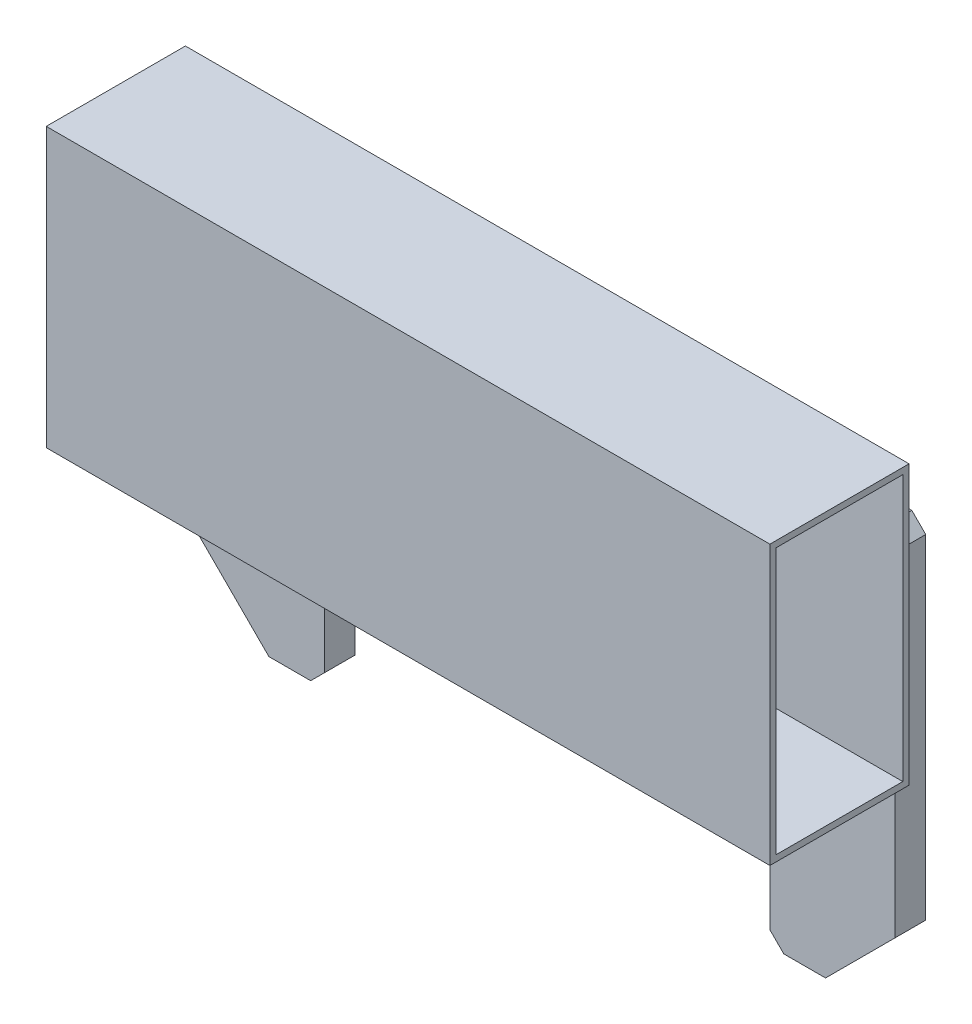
ISO-10303-21;
HEADER;
FILE_DESCRIPTION(('STEP AP214'),'2;1');
FILE_NAME('part.step','',(''),(''),'','','');
FILE_SCHEMA(('AUTOMOTIVE_DESIGN { 1 0 10303 214 1 1 1 1 }'));
ENDSEC;
DATA;
#1=APPLICATION_CONTEXT('core data for automotive mechanical design processes');
#2=APPLICATION_PROTOCOL_DEFINITION('international standard','automotive_design',2000,#1);
#3=PRODUCT_CONTEXT('',#1,'mechanical');
#4=PRODUCT('Part','Part','',(#3));
#5=PRODUCT_RELATED_PRODUCT_CATEGORY('part','',(#4));
#6=PRODUCT_DEFINITION_FORMATION('','',#4);
#7=PRODUCT_DEFINITION_CONTEXT('part definition',#1,'design');
#8=PRODUCT_DEFINITION('design','',#6,#7);
#9=PRODUCT_DEFINITION_SHAPE('','',#8);
#10=(LENGTH_UNIT() NAMED_UNIT(*) SI_UNIT(.MILLI.,.METRE.));
#11=(NAMED_UNIT(*) PLANE_ANGLE_UNIT() SI_UNIT($,.RADIAN.));
#12=(NAMED_UNIT(*) SI_UNIT($,.STERADIAN.) SOLID_ANGLE_UNIT());
#13=UNCERTAINTY_MEASURE_WITH_UNIT(LENGTH_MEASURE(1.E-05),#10,'distance_accuracy_value','');
#14=(GEOMETRIC_REPRESENTATION_CONTEXT(3) GLOBAL_UNCERTAINTY_ASSIGNED_CONTEXT((#13)) GLOBAL_UNIT_ASSIGNED_CONTEXT((#10,
#11,#12)) REPRESENTATION_CONTEXT('',''));
#15=CARTESIAN_POINT('',(0.,0.,0.));
#16=DIRECTION('',(0.,0.,1.));
#17=DIRECTION('',(1.,0.,0.));
#18=AXIS2_PLACEMENT_3D('',#15,#16,#17);
#19=CARTESIAN_POINT('',(-520.,378.,0.));
#20=DIRECTION('',(0.,0.,-1.));
#21=DIRECTION('',(0.,1.,0.));
#22=AXIS2_PLACEMENT_3D('',#19,#20,#21);
#23=PLANE('',#22);
#24=DIRECTION('',(0.,1.,0.));
#25=VECTOR('',#24,1.);
#26=CARTESIAN_POINT('',(-420.,528.,0.));
#27=LINE('',#26,#25);
#28=CARTESIAN_POINT('',(-420.,378.,0.));
#29=VERTEX_POINT('',#28);
#30=CARTESIAN_POINT('',(-420.,518.,0.));
#31=VERTEX_POINT('',#30);
#32=EDGE_CURVE('E334',#29,#31,#27,.T.);
#33=ORIENTED_EDGE('',*,*,#32,.T.);
#34=DIRECTION('',(0.707106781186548,-0.707106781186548,0.));
#35=VECTOR('',#34,1.);
#36=CARTESIAN_POINT('',(-420.,518.,0.));
#37=LINE('',#36,#35);
#38=CARTESIAN_POINT('',(-430.,528.,0.));
#39=VERTEX_POINT('',#38);
#40=EDGE_CURVE('E341',#31,#39,#37,.F.);
#41=ORIENTED_EDGE('',*,*,#40,.T.);
#42=DIRECTION('',(-1.,0.,0.));
#43=VECTOR('',#42,1.);
#44=CARTESIAN_POINT('',(-420.,528.,0.));
#45=LINE('',#44,#43);
#46=CARTESIAN_POINT('',(-500.,528.,0.));
#47=VERTEX_POINT('',#46);
#48=EDGE_CURVE('E218',#39,#47,#45,.T.);
#49=ORIENTED_EDGE('',*,*,#48,.T.);
#50=DIRECTION('',(0.707106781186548,0.707106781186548,0.));
#51=VECTOR('',#50,1.);
#52=CARTESIAN_POINT('',(-500.,528.,0.));
#53=LINE('',#52,#51);
#54=CARTESIAN_POINT('',(-510.,518.,0.));
#55=VERTEX_POINT('',#54);
#56=EDGE_CURVE('E193',#47,#55,#53,.F.);
#57=ORIENTED_EDGE('',*,*,#56,.T.);
#58=DIRECTION('',(0.,-1.,0.));
#59=VECTOR('',#58,1.);
#60=CARTESIAN_POINT('',(-510.,528.,0.));
#61=LINE('',#60,#59);
#62=CARTESIAN_POINT('',(-510.,378.,0.));
#63=VERTEX_POINT('',#62);
#64=EDGE_CURVE('E185',#55,#63,#61,.T.);
#65=ORIENTED_EDGE('',*,*,#64,.T.);
#66=DIRECTION('',(1.,0.,0.));
#67=VECTOR('',#66,1.);
#68=CARTESIAN_POINT('',(-520.,378.,0.));
#69=LINE('',#68,#67);
#70=CARTESIAN_POINT('',(-520.,378.,0.));
#71=VERTEX_POINT('',#70);
#72=EDGE_CURVE('E190',#71,#63,#69,.T.);
#73=ORIENTED_EDGE('',*,*,#72,.F.);
#74=DIRECTION('',(0.,1.,0.));
#75=VECTOR('',#74,1.);
#76=CARTESIAN_POINT('',(-520.,378.,0.));
#77=LINE('',#76,#75);
#78=CARTESIAN_POINT('',(-520.,578.,0.));
#79=VERTEX_POINT('',#78);
#80=EDGE_CURVE('E257',#71,#79,#77,.T.);
#81=ORIENTED_EDGE('',*,*,#80,.T.);
#82=DIRECTION('',(1.,0.,0.));
#83=VECTOR('',#82,1.);
#84=CARTESIAN_POINT('',(-520.,578.,0.));
#85=LINE('',#84,#83);
#86=CARTESIAN_POINT('',(0.,578.,0.));
#87=VERTEX_POINT('',#86);
#88=EDGE_CURVE('E361',#79,#87,#85,.T.);
#89=ORIENTED_EDGE('',*,*,#88,.T.);
#90=DIRECTION('',(0.,1.,0.));
#91=VECTOR('',#90,1.);
#92=CARTESIAN_POINT('',(0.,378.,0.));
#93=LINE('',#92,#91);
#94=CARTESIAN_POINT('',(0.,378.,0.));
#95=VERTEX_POINT('',#94);
#96=EDGE_CURVE('E281',#95,#87,#93,.T.);
#97=ORIENTED_EDGE('',*,*,#96,.F.);
#98=CARTESIAN_POINT('',(-10.,378.,0.));
#99=VERTEX_POINT('',#98);
#100=EDGE_CURVE('E211',#99,#95,#69,.T.);
#101=ORIENTED_EDGE('',*,*,#100,.F.);
#102=DIRECTION('',(0.,1.,0.));
#103=VECTOR('',#102,1.);
#104=CARTESIAN_POINT('',(-10.,228.,0.));
#105=LINE('',#104,#103);
#106=CARTESIAN_POINT('',(-10.,518.,0.));
#107=VERTEX_POINT('',#106);
#108=EDGE_CURVE('E318',#99,#107,#105,.T.);
#109=ORIENTED_EDGE('',*,*,#108,.T.);
#110=DIRECTION('',(0.707106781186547,-0.707106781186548,0.));
#111=VECTOR('',#110,1.);
#112=CARTESIAN_POINT('',(-10.,518.,0.));
#113=LINE('',#112,#111);
#114=CARTESIAN_POINT('',(-20.,528.,0.));
#115=VERTEX_POINT('',#114);
#116=EDGE_CURVE('E409',#107,#115,#113,.F.);
#117=ORIENTED_EDGE('',*,*,#116,.T.);
#118=DIRECTION('',(-1.,0.,0.));
#119=VECTOR('',#118,1.);
#120=CARTESIAN_POINT('',(-10.,528.,0.));
#121=LINE('',#120,#119);
#122=CARTESIAN_POINT('',(-90.,528.,0.));
#123=VERTEX_POINT('',#122);
#124=EDGE_CURVE('E300',#115,#123,#121,.T.);
#125=ORIENTED_EDGE('',*,*,#124,.T.);
#126=DIRECTION('',(0.707106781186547,0.707106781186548,0.));
#127=VECTOR('',#126,1.);
#128=CARTESIAN_POINT('',(-90.,528.,0.));
#129=LINE('',#128,#127);
#130=CARTESIAN_POINT('',(-100.,518.,0.));
#131=VERTEX_POINT('',#130);
#132=EDGE_CURVE('E407',#123,#131,#129,.F.);
#133=ORIENTED_EDGE('',*,*,#132,.T.);
#134=DIRECTION('',(0.,-1.,0.));
#135=VECTOR('',#134,1.);
#136=CARTESIAN_POINT('',(-100.,528.,0.));
#137=LINE('',#136,#135);
#138=CARTESIAN_POINT('',(-100.,378.,0.));
#139=VERTEX_POINT('',#138);
#140=EDGE_CURVE('E307',#131,#139,#137,.T.);
#141=ORIENTED_EDGE('',*,*,#140,.T.);
#142=EDGE_CURVE('E209',#29,#139,#69,.T.);
#143=ORIENTED_EDGE('',*,*,#142,.F.);
#144=EDGE_LOOP('',(#33,#41,#49,#57,#65,#73,#81,#89,#97,#101,#109,#117,#125,#133,#141,#143));
#145=FACE_BOUND('',#144,.T.);
#146=ADVANCED_FACE('F16',(#145),#23,.T.);
#147=CARTESIAN_POINT('',(-520.,578.,0.));
#148=DIRECTION('',(0.,1.,0.));
#149=DIRECTION('',(0.,0.,1.));
#150=AXIS2_PLACEMENT_3D('',#147,#148,#149);
#151=PLANE('',#150);
#152=DIRECTION('',(0.,0.,1.));
#153=VECTOR('',#152,1.);
#154=CARTESIAN_POINT('',(0.,578.,0.));
#155=LINE('',#154,#153);
#156=CARTESIAN_POINT('',(0.,578.,100.));
#157=VERTEX_POINT('',#156);
#158=EDGE_CURVE('E285',#87,#157,#155,.T.);
#159=ORIENTED_EDGE('',*,*,#158,.F.);
#160=ORIENTED_EDGE('',*,*,#88,.F.);
#161=DIRECTION('',(0.,0.,1.));
#162=VECTOR('',#161,1.);
#163=CARTESIAN_POINT('',(-520.,578.,0.));
#164=LINE('',#163,#162);
#165=CARTESIAN_POINT('',(-520.,578.,100.));
#166=VERTEX_POINT('',#165);
#167=EDGE_CURVE('E259',#79,#166,#164,.T.);
#168=ORIENTED_EDGE('',*,*,#167,.T.);
#169=DIRECTION('',(1.,0.,0.));
#170=VECTOR('',#169,1.);
#171=CARTESIAN_POINT('',(-520.,578.,100.));
#172=LINE('',#171,#170);
#173=EDGE_CURVE('E226',#166,#157,#172,.T.);
#174=ORIENTED_EDGE('',*,*,#173,.T.);
#175=EDGE_LOOP('',(#159,#160,#168,#174));
#176=FACE_BOUND('',#175,.T.);
#177=ADVANCED_FACE('F454',(#176),#151,.T.);
#178=CARTESIAN_POINT('',(-520.,578.,100.));
#179=DIRECTION('',(0.,0.,1.));
#180=DIRECTION('',(1.,0.,0.));
#181=AXIS2_PLACEMENT_3D('',#178,#179,#180);
#182=PLANE('',#181);
#183=DIRECTION('',(0.,-1.,0.));
#184=VECTOR('',#183,1.);
#185=CARTESIAN_POINT('',(0.,578.,100.));
#186=LINE('',#185,#184);
#187=CARTESIAN_POINT('',(0.,378.,100.));
#188=VERTEX_POINT('',#187);
#189=EDGE_CURVE('E289',#157,#188,#186,.T.);
#190=ORIENTED_EDGE('',*,*,#189,.F.);
#191=ORIENTED_EDGE('',*,*,#173,.F.);
#192=DIRECTION('',(0.,-1.,0.));
#193=VECTOR('',#192,1.);
#194=CARTESIAN_POINT('',(-520.,578.,100.));
#195=LINE('',#194,#193);
#196=CARTESIAN_POINT('',(-520.,378.,100.));
#197=VERTEX_POINT('',#196);
#198=EDGE_CURVE('E262',#166,#197,#195,.T.);
#199=ORIENTED_EDGE('',*,*,#198,.T.);
#200=DIRECTION('',(1.,0.,0.));
#201=VECTOR('',#200,1.);
#202=CARTESIAN_POINT('',(-520.,378.,100.));
#203=LINE('',#202,#201);
#204=EDGE_CURVE('E224',#197,#188,#203,.T.);
#205=ORIENTED_EDGE('',*,*,#204,.T.);
#206=EDGE_LOOP('',(#190,#191,#199,#205));
#207=FACE_BOUND('',#206,.T.);
#208=ADVANCED_FACE('F449',(#207),#182,.T.);
#209=CARTESIAN_POINT('',(-520.,573.5,4.5));
#210=DIRECTION('',(0.,1.,0.));
#211=DIRECTION('',(0.,0.,1.));
#212=AXIS2_PLACEMENT_3D('',#209,#210,#211);
#213=PLANE('',#212);
#214=DIRECTION('',(0.,0.,1.));
#215=VECTOR('',#214,1.);
#216=CARTESIAN_POINT('',(0.,573.5,4.5));
#217=LINE('',#216,#215);
#218=CARTESIAN_POINT('',(0.,573.5,4.5));
#219=VERTEX_POINT('',#218);
#220=CARTESIAN_POINT('',(0.,573.5,95.5));
#221=VERTEX_POINT('',#220);
#222=EDGE_CURVE('E260',#219,#221,#217,.T.);
#223=ORIENTED_EDGE('',*,*,#222,.T.);
#224=DIRECTION('',(1.,0.,0.));
#225=VECTOR('',#224,1.);
#226=CARTESIAN_POINT('',(-520.,573.5,95.5));
#227=LINE('',#226,#225);
#228=CARTESIAN_POINT('',(-520.,573.5,95.5));
#229=VERTEX_POINT('',#228);
#230=EDGE_CURVE('E243',#229,#221,#227,.T.);
#231=ORIENTED_EDGE('',*,*,#230,.F.);
#232=DIRECTION('',(0.,0.,1.));
#233=VECTOR('',#232,1.);
#234=CARTESIAN_POINT('',(-520.,573.5,4.5));
#235=LINE('',#234,#233);
#236=CARTESIAN_POINT('',(-520.,573.5,4.5));
#237=VERTEX_POINT('',#236);
#238=EDGE_CURVE('E245',#237,#229,#235,.T.);
#239=ORIENTED_EDGE('',*,*,#238,.F.);
#240=DIRECTION('',(1.,0.,0.));
#241=VECTOR('',#240,1.);
#242=CARTESIAN_POINT('',(-520.,573.5,4.5));
#243=LINE('',#242,#241);
#244=EDGE_CURVE('E231',#237,#219,#243,.T.);
#245=ORIENTED_EDGE('',*,*,#244,.T.);
#246=EDGE_LOOP('',(#223,#231,#239,#245));
#247=FACE_BOUND('',#246,.T.);
#248=ADVANCED_FACE('F461',(#247),#213,.F.);
#249=CARTESIAN_POINT('',(-520.,382.5,4.5));
#250=DIRECTION('',(0.,0.,-1.));
#251=DIRECTION('',(0.,1.,0.));
#252=AXIS2_PLACEMENT_3D('',#249,#250,#251);
#253=PLANE('',#252);
#254=DIRECTION('',(0.,1.,0.));
#255=VECTOR('',#254,1.);
#256=CARTESIAN_POINT('',(0.,382.5,4.5));
#257=LINE('',#256,#255);
#258=CARTESIAN_POINT('',(0.,382.5,4.5));
#259=VERTEX_POINT('',#258);
#260=EDGE_CURVE('E277',#259,#219,#257,.T.);
#261=ORIENTED_EDGE('',*,*,#260,.T.);
#262=ORIENTED_EDGE('',*,*,#244,.F.);
#263=DIRECTION('',(0.,1.,0.));
#264=VECTOR('',#263,1.);
#265=CARTESIAN_POINT('',(-520.,382.5,4.5));
#266=LINE('',#265,#264);
#267=CARTESIAN_POINT('',(-520.,382.5,4.5));
#268=VERTEX_POINT('',#267);
#269=EDGE_CURVE('E254',#268,#237,#266,.T.);
#270=ORIENTED_EDGE('',*,*,#269,.F.);
#271=DIRECTION('',(1.,0.,0.));
#272=VECTOR('',#271,1.);
#273=CARTESIAN_POINT('',(-520.,382.5,4.5));
#274=LINE('',#273,#272);
#275=EDGE_CURVE('E234',#268,#259,#274,.T.);
#276=ORIENTED_EDGE('',*,*,#275,.T.);
#277=EDGE_LOOP('',(#261,#262,#270,#276));
#278=FACE_BOUND('',#277,.T.);
#279=ADVANCED_FACE('F467',(#278),#253,.F.);
#280=CARTESIAN_POINT('',(-520.,382.5,95.5));
#281=DIRECTION('',(0.,-1.,0.));
#282=DIRECTION('',(0.,0.,-1.));
#283=AXIS2_PLACEMENT_3D('',#280,#281,#282);
#284=PLANE('',#283);
#285=DIRECTION('',(0.,0.,-1.));
#286=VECTOR('',#285,1.);
#287=CARTESIAN_POINT('',(0.,382.5,95.5));
#288=LINE('',#287,#286);
#289=CARTESIAN_POINT('',(0.,382.5,95.5));
#290=VERTEX_POINT('',#289);
#291=EDGE_CURVE('E273',#290,#259,#288,.T.);
#292=ORIENTED_EDGE('',*,*,#291,.T.);
#293=ORIENTED_EDGE('',*,*,#275,.F.);
#294=DIRECTION('',(0.,0.,-1.));
#295=VECTOR('',#294,1.);
#296=CARTESIAN_POINT('',(-520.,382.5,95.5));
#297=LINE('',#296,#295);
#298=CARTESIAN_POINT('',(-520.,382.5,95.5));
#299=VERTEX_POINT('',#298);
#300=EDGE_CURVE('E251',#299,#268,#297,.T.);
#301=ORIENTED_EDGE('',*,*,#300,.F.);
#302=DIRECTION('',(1.,0.,0.));
#303=VECTOR('',#302,1.);
#304=CARTESIAN_POINT('',(-520.,382.5,95.5));
#305=LINE('',#304,#303);
#306=EDGE_CURVE('E240',#299,#290,#305,.T.);
#307=ORIENTED_EDGE('',*,*,#306,.T.);
#308=EDGE_LOOP('',(#292,#293,#301,#307));
#309=FACE_BOUND('',#308,.T.);
#310=ADVANCED_FACE('F470',(#309),#284,.F.);
#311=CARTESIAN_POINT('',(-520.,573.5,95.5));
#312=DIRECTION('',(0.,0.,1.));
#313=DIRECTION('',(0.,-1.,0.));
#314=AXIS2_PLACEMENT_3D('',#311,#312,#313);
#315=PLANE('',#314);
#316=DIRECTION('',(0.,-1.,0.));
#317=VECTOR('',#316,1.);
#318=CARTESIAN_POINT('',(0.,573.5,95.5));
#319=LINE('',#318,#317);
#320=EDGE_CURVE('E269',#221,#290,#319,.T.);
#321=ORIENTED_EDGE('',*,*,#320,.T.);
#322=ORIENTED_EDGE('',*,*,#306,.F.);
#323=DIRECTION('',(0.,-1.,0.));
#324=VECTOR('',#323,1.);
#325=CARTESIAN_POINT('',(-520.,573.5,95.5));
#326=LINE('',#325,#324);
#327=EDGE_CURVE('E248',#229,#299,#326,.T.);
#328=ORIENTED_EDGE('',*,*,#327,.F.);
#329=ORIENTED_EDGE('',*,*,#230,.T.);
#330=EDGE_LOOP('',(#321,#322,#328,#329));
#331=FACE_BOUND('',#330,.T.);
#332=ADVANCED_FACE('F466',(#331),#315,.F.);
#333=CARTESIAN_POINT('',(-520.,378.,100.));
#334=DIRECTION('',(0.,-1.,0.));
#335=DIRECTION('',(0.,0.,-1.));
#336=AXIS2_PLACEMENT_3D('',#333,#334,#335);
#337=PLANE('',#336);
#338=DIRECTION('',(0.,0.,-1.));
#339=VECTOR('',#338,1.);
#340=CARTESIAN_POINT('',(0.,378.,100.));
#341=LINE('',#340,#339);
#342=EDGE_CURVE('E280',#188,#95,#341,.T.);
#343=ORIENTED_EDGE('',*,*,#342,.F.);
#344=ORIENTED_EDGE('',*,*,#204,.F.);
#345=DIRECTION('',(0.,0.,-1.));
#346=VECTOR('',#345,1.);
#347=CARTESIAN_POINT('',(-520.,378.,100.));
#348=LINE('',#347,#346);
#349=EDGE_CURVE('E222',#197,#71,#348,.T.);
#350=ORIENTED_EDGE('',*,*,#349,.T.);
#351=ORIENTED_EDGE('',*,*,#72,.T.);
#352=EDGE_CURVE('E202',#63,#29,#69,.T.);
#353=ORIENTED_EDGE('',*,*,#352,.T.);
#354=ORIENTED_EDGE('',*,*,#142,.T.);
#355=EDGE_CURVE('E225',#139,#99,#69,.T.);
#356=ORIENTED_EDGE('',*,*,#355,.T.);
#357=ORIENTED_EDGE('',*,*,#100,.T.);
#358=EDGE_LOOP('',(#343,#344,#350,#351,#353,#354,#356,#357));
#359=FACE_BOUND('',#358,.T.);
#360=ADVANCED_FACE('F220',(#359),#337,.T.);
#361=CARTESIAN_POINT('',(-520.,578.,0.));
#362=DIRECTION('',(1.,0.,0.));
#363=DIRECTION('',(0.,1.,0.));
#364=AXIS2_PLACEMENT_3D('',#361,#362,#363);
#365=PLANE('',#364);
#366=ORIENTED_EDGE('',*,*,#238,.T.);
#367=ORIENTED_EDGE('',*,*,#327,.T.);
#368=ORIENTED_EDGE('',*,*,#300,.T.);
#369=ORIENTED_EDGE('',*,*,#269,.T.);
#370=EDGE_LOOP('',(#366,#367,#368,#369));
#371=FACE_BOUND('',#370,.T.);
#372=ORIENTED_EDGE('',*,*,#80,.F.);
#373=ORIENTED_EDGE('',*,*,#349,.F.);
#374=ORIENTED_EDGE('',*,*,#198,.F.);
#375=ORIENTED_EDGE('',*,*,#167,.F.);
#376=EDGE_LOOP('',(#372,#373,#374,#375));
#377=FACE_BOUND('',#376,.T.);
#378=ADVANCED_FACE('F452',(#371,#377),#365,.F.);
#379=CARTESIAN_POINT('',(0.,578.,0.));
#380=DIRECTION('',(1.,0.,0.));
#381=DIRECTION('',(0.,1.,0.));
#382=AXIS2_PLACEMENT_3D('',#379,#380,#381);
#383=PLANE('',#382);
#384=ORIENTED_EDGE('',*,*,#222,.F.);
#385=ORIENTED_EDGE('',*,*,#260,.F.);
#386=ORIENTED_EDGE('',*,*,#291,.F.);
#387=ORIENTED_EDGE('',*,*,#320,.F.);
#388=EDGE_LOOP('',(#384,#385,#386,#387));
#389=FACE_BOUND('',#388,.T.);
#390=ORIENTED_EDGE('',*,*,#96,.T.);
#391=ORIENTED_EDGE('',*,*,#158,.T.);
#392=ORIENTED_EDGE('',*,*,#189,.T.);
#393=ORIENTED_EDGE('',*,*,#342,.T.);
#394=EDGE_LOOP('',(#390,#391,#392,#393));
#395=FACE_BOUND('',#394,.T.);
#396=ADVANCED_FACE('F445',(#389,#395),#383,.T.);
#397=CARTESIAN_POINT('',(-100.,228.,0.));
#398=DIRECTION('',(0.,0.,1.));
#399=DIRECTION('',(1.,0.,0.));
#400=AXIS2_PLACEMENT_3D('',#397,#398,#399);
#401=PLANE('',#400);
#402=DIRECTION('',(1.,0.,0.));
#403=VECTOR('',#402,1.);
#404=CARTESIAN_POINT('',(-100.,228.,0.));
#405=LINE('',#404,#403);
#406=CARTESIAN_POINT('',(-90.,228.,0.));
#407=VERTEX_POINT('',#406);
#408=CARTESIAN_POINT('',(-60.,228.,0.));
#409=VERTEX_POINT('',#408);
#410=EDGE_CURVE('E310',#407,#409,#405,.T.);
#411=ORIENTED_EDGE('',*,*,#410,.T.);
#412=DIRECTION('',(-0.707106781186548,-0.707106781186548,0.));
#413=VECTOR('',#412,1.);
#414=CARTESIAN_POINT('',(-80.,208.,0.));
#415=LINE('',#414,#413);
#416=CARTESIAN_POINT('',(-10.,278.,0.));
#417=VERTEX_POINT('',#416);
#418=EDGE_CURVE('E414',#409,#417,#415,.F.);
#419=ORIENTED_EDGE('',*,*,#418,.T.);
#420=EDGE_CURVE('E315',#417,#99,#105,.T.);
#421=ORIENTED_EDGE('',*,*,#420,.T.);
#422=ORIENTED_EDGE('',*,*,#355,.F.);
#423=CARTESIAN_POINT('',(-100.,238.,0.));
#424=VERTEX_POINT('',#423);
#425=EDGE_CURVE('E311',#139,#424,#137,.T.);
#426=ORIENTED_EDGE('',*,*,#425,.T.);
#427=DIRECTION('',(-0.707106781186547,0.707106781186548,0.));
#428=VECTOR('',#427,1.);
#429=CARTESIAN_POINT('',(-95.,233.,0.));
#430=LINE('',#429,#428);
#431=EDGE_CURVE('E396',#424,#407,#430,.F.);
#432=ORIENTED_EDGE('',*,*,#431,.T.);
#433=EDGE_LOOP('',(#411,#419,#421,#422,#426,#432));
#434=FACE_BOUND('',#433,.T.);
#435=ADVANCED_FACE('F437',(#434),#401,.T.);
#436=CARTESIAN_POINT('',(-100.,528.,-22.));
#437=DIRECTION('',(-1.,0.,0.));
#438=DIRECTION('',(0.,-1.,0.));
#439=AXIS2_PLACEMENT_3D('',#436,#437,#438);
#440=PLANE('',#439);
#441=ORIENTED_EDGE('',*,*,#140,.F.);
#442=DIRECTION('',(0.,0.,-1.));
#443=VECTOR('',#442,1.);
#444=CARTESIAN_POINT('',(-100.,518.,-22.));
#445=LINE('',#444,#443);
#446=CARTESIAN_POINT('',(-100.,518.,-22.));
#447=VERTEX_POINT('',#446);
#448=EDGE_CURVE('E384',#131,#447,#445,.T.);
#449=ORIENTED_EDGE('',*,*,#448,.T.);
#450=DIRECTION('',(0.,-1.,0.));
#451=VECTOR('',#450,1.);
#452=CARTESIAN_POINT('',(-100.,528.,-22.));
#453=LINE('',#452,#451);
#454=CARTESIAN_POINT('',(-100.,238.,-22.));
#455=VERTEX_POINT('',#454);
#456=EDGE_CURVE('E296',#447,#455,#453,.T.);
#457=ORIENTED_EDGE('',*,*,#456,.T.);
#458=DIRECTION('',(0.,0.,1.));
#459=VECTOR('',#458,1.);
#460=CARTESIAN_POINT('',(-100.,238.,-22.));
#461=LINE('',#460,#459);
#462=EDGE_CURVE('E381',#455,#424,#461,.T.);
#463=ORIENTED_EDGE('',*,*,#462,.T.);
#464=ORIENTED_EDGE('',*,*,#425,.F.);
#465=EDGE_LOOP('',(#441,#449,#457,#463,#464));
#466=FACE_BOUND('',#465,.T.);
#467=ADVANCED_FACE('F486',(#466),#440,.T.);
#468=CARTESIAN_POINT('',(-100.,228.,-22.));
#469=DIRECTION('',(0.,-1.,0.));
#470=DIRECTION('',(0.,0.,-1.));
#471=AXIS2_PLACEMENT_3D('',#468,#469,#470);
#472=PLANE('',#471);
#473=DIRECTION('',(1.,0.,0.));
#474=VECTOR('',#473,1.);
#475=CARTESIAN_POINT('',(-100.,228.,-22.));
#476=LINE('',#475,#474);
#477=CARTESIAN_POINT('',(-90.,228.,-22.));
#478=VERTEX_POINT('',#477);
#479=CARTESIAN_POINT('',(-60.,228.,-22.));
#480=VERTEX_POINT('',#479);
#481=EDGE_CURVE('E299',#478,#480,#476,.T.);
#482=ORIENTED_EDGE('',*,*,#481,.T.);
#483=DIRECTION('',(0.,0.,1.));
#484=VECTOR('',#483,1.);
#485=CARTESIAN_POINT('',(-60.,228.,-22.));
#486=LINE('',#485,#484);
#487=EDGE_CURVE('E411',#480,#409,#486,.T.);
#488=ORIENTED_EDGE('',*,*,#487,.T.);
#489=ORIENTED_EDGE('',*,*,#410,.F.);
#490=DIRECTION('',(0.,0.,-1.));
#491=VECTOR('',#490,1.);
#492=CARTESIAN_POINT('',(-90.,228.,-22.));
#493=LINE('',#492,#491);
#494=EDGE_CURVE('E398',#407,#478,#493,.T.);
#495=ORIENTED_EDGE('',*,*,#494,.T.);
#496=EDGE_LOOP('',(#482,#488,#489,#495));
#497=FACE_BOUND('',#496,.T.);
#498=ADVANCED_FACE('F431',(#497),#472,.T.);
#499=CARTESIAN_POINT('',(-10.,228.,-22.));
#500=DIRECTION('',(1.,0.,0.));
#501=DIRECTION('',(0.,0.,-1.));
#502=AXIS2_PLACEMENT_3D('',#499,#500,#501);
#503=PLANE('',#502);
#504=ORIENTED_EDGE('',*,*,#420,.F.);
#505=DIRECTION('',(0.,0.,-1.));
#506=VECTOR('',#505,1.);
#507=CARTESIAN_POINT('',(-10.,278.,-22.));
#508=LINE('',#507,#506);
#509=CARTESIAN_POINT('',(-10.,278.,-22.));
#510=VERTEX_POINT('',#509);
#511=EDGE_CURVE('E416',#417,#510,#508,.T.);
#512=ORIENTED_EDGE('',*,*,#511,.T.);
#513=DIRECTION('',(0.,1.,0.));
#514=VECTOR('',#513,1.);
#515=CARTESIAN_POINT('',(-10.,228.,-22.));
#516=LINE('',#515,#514);
#517=CARTESIAN_POINT('',(-10.,518.,-22.));
#518=VERTEX_POINT('',#517);
#519=EDGE_CURVE('E303',#510,#518,#516,.T.);
#520=ORIENTED_EDGE('',*,*,#519,.T.);
#521=DIRECTION('',(0.,0.,1.));
#522=VECTOR('',#521,1.);
#523=CARTESIAN_POINT('',(-10.,518.,-22.));
#524=LINE('',#523,#522);
#525=EDGE_CURVE('E393',#518,#107,#524,.T.);
#526=ORIENTED_EDGE('',*,*,#525,.T.);
#527=ORIENTED_EDGE('',*,*,#108,.F.);
#528=EDGE_LOOP('',(#504,#512,#520,#526,#527));
#529=FACE_BOUND('',#528,.T.);
#530=ADVANCED_FACE('F440',(#529),#503,.T.);
#531=CARTESIAN_POINT('',(-10.,528.,-22.));
#532=DIRECTION('',(0.,1.,0.));
#533=DIRECTION('',(0.,0.,1.));
#534=AXIS2_PLACEMENT_3D('',#531,#532,#533);
#535=PLANE('',#534);
#536=DIRECTION('',(-1.,0.,0.));
#537=VECTOR('',#536,1.);
#538=CARTESIAN_POINT('',(-10.,528.,-22.));
#539=LINE('',#538,#537);
#540=CARTESIAN_POINT('',(-20.,528.,-22.));
#541=VERTEX_POINT('',#540);
#542=CARTESIAN_POINT('',(-90.,528.,-22.));
#543=VERTEX_POINT('',#542);
#544=EDGE_CURVE('E286',#541,#543,#539,.T.);
#545=ORIENTED_EDGE('',*,*,#544,.T.);
#546=DIRECTION('',(0.,0.,1.));
#547=VECTOR('',#546,1.);
#548=CARTESIAN_POINT('',(-90.,528.,-22.));
#549=LINE('',#548,#547);
#550=EDGE_CURVE('E378',#543,#123,#549,.T.);
#551=ORIENTED_EDGE('',*,*,#550,.T.);
#552=ORIENTED_EDGE('',*,*,#124,.F.);
#553=DIRECTION('',(0.,0.,-1.));
#554=VECTOR('',#553,1.);
#555=CARTESIAN_POINT('',(-20.,528.,-22.));
#556=LINE('',#555,#554);
#557=EDGE_CURVE('E376',#115,#541,#556,.T.);
#558=ORIENTED_EDGE('',*,*,#557,.T.);
#559=EDGE_LOOP('',(#545,#551,#552,#558));
#560=FACE_BOUND('',#559,.T.);
#561=ADVANCED_FACE('F494',(#560),#535,.T.);
#562=CARTESIAN_POINT('',(-100.,228.,-22.));
#563=DIRECTION('',(0.,0.,1.));
#564=DIRECTION('',(1.,0.,0.));
#565=AXIS2_PLACEMENT_3D('',#562,#563,#564);
#566=PLANE('',#565);
#567=ORIENTED_EDGE('',*,*,#519,.F.);
#568=DIRECTION('',(0.707106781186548,0.707106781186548,0.));
#569=VECTOR('',#568,1.);
#570=CARTESIAN_POINT('',(-60.,228.,-22.));
#571=LINE('',#570,#569);
#572=EDGE_CURVE('E418',#510,#480,#571,.F.);
#573=ORIENTED_EDGE('',*,*,#572,.T.);
#574=ORIENTED_EDGE('',*,*,#481,.F.);
#575=DIRECTION('',(0.707106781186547,-0.707106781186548,0.));
#576=VECTOR('',#575,1.);
#577=CARTESIAN_POINT('',(-100.,238.,-22.));
#578=LINE('',#577,#576);
#579=EDGE_CURVE('E386',#478,#455,#578,.F.);
#580=ORIENTED_EDGE('',*,*,#579,.T.);
#581=ORIENTED_EDGE('',*,*,#456,.F.);
#582=DIRECTION('',(-0.707106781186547,-0.707106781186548,0.));
#583=VECTOR('',#582,1.);
#584=CARTESIAN_POINT('',(-90.,528.,-22.));
#585=LINE('',#584,#583);
#586=EDGE_CURVE('E391',#447,#543,#585,.F.);
#587=ORIENTED_EDGE('',*,*,#586,.T.);
#588=ORIENTED_EDGE('',*,*,#544,.F.);
#589=DIRECTION('',(-0.707106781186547,0.707106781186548,0.));
#590=VECTOR('',#589,1.);
#591=CARTESIAN_POINT('',(-10.,518.,-22.));
#592=LINE('',#591,#590);
#593=EDGE_CURVE('E388',#541,#518,#592,.F.);
#594=ORIENTED_EDGE('',*,*,#593,.T.);
#595=EDGE_LOOP('',(#567,#573,#574,#580,#581,#587,#588,#594));
#596=FACE_BOUND('',#595,.T.);
#597=ADVANCED_FACE('F425',(#596),#566,.F.);
#598=CARTESIAN_POINT('',(-420.,528.,-22.));
#599=DIRECTION('',(1.,0.,0.));
#600=DIRECTION('',(0.,1.,0.));
#601=AXIS2_PLACEMENT_3D('',#598,#599,#600);
#602=PLANE('',#601);
#603=DIRECTION('',(0.,1.,0.));
#604=VECTOR('',#603,1.);
#605=CARTESIAN_POINT('',(-420.,528.,-22.));
#606=LINE('',#605,#604);
#607=CARTESIAN_POINT('',(-420.,238.,-22.));
#608=VERTEX_POINT('',#607);
#609=CARTESIAN_POINT('',(-420.,518.,-22.));
#610=VERTEX_POINT('',#609);
#611=EDGE_CURVE('E322',#608,#610,#606,.T.);
#612=ORIENTED_EDGE('',*,*,#611,.T.);
#613=DIRECTION('',(0.,0.,1.));
#614=VECTOR('',#613,1.);
#615=CARTESIAN_POINT('',(-420.,518.,-22.));
#616=LINE('',#615,#614);
#617=EDGE_CURVE('E374',#610,#31,#616,.T.);
#618=ORIENTED_EDGE('',*,*,#617,.T.);
#619=ORIENTED_EDGE('',*,*,#32,.F.);
#620=CARTESIAN_POINT('',(-420.,238.,0.));
#621=VERTEX_POINT('',#620);
#622=EDGE_CURVE('E205',#621,#29,#27,.T.);
#623=ORIENTED_EDGE('',*,*,#622,.F.);
#624=DIRECTION('',(0.,0.,-1.));
#625=VECTOR('',#624,1.);
#626=CARTESIAN_POINT('',(-420.,238.,-22.));
#627=LINE('',#626,#625);
#628=EDGE_CURVE('E372',#621,#608,#627,.T.);
#629=ORIENTED_EDGE('',*,*,#628,.T.);
#630=EDGE_LOOP('',(#612,#618,#619,#623,#629));
#631=FACE_BOUND('',#630,.T.);
#632=ADVANCED_FACE('F500',(#631),#602,.T.);
#633=CARTESIAN_POINT('',(-420.,528.,-22.));
#634=DIRECTION('',(0.,1.,0.));
#635=DIRECTION('',(0.,0.,1.));
#636=AXIS2_PLACEMENT_3D('',#633,#634,#635);
#637=PLANE('',#636);
#638=DIRECTION('',(-1.,0.,0.));
#639=VECTOR('',#638,1.);
#640=CARTESIAN_POINT('',(-420.,528.,-22.));
#641=LINE('',#640,#639);
#642=CARTESIAN_POINT('',(-430.,528.,-22.));
#643=VERTEX_POINT('',#642);
#644=CARTESIAN_POINT('',(-500.,528.,-22.));
#645=VERTEX_POINT('',#644);
#646=EDGE_CURVE('E325',#643,#645,#641,.T.);
#647=ORIENTED_EDGE('',*,*,#646,.T.);
#648=DIRECTION('',(0.,0.,1.));
#649=VECTOR('',#648,1.);
#650=CARTESIAN_POINT('',(-500.,528.,-22.));
#651=LINE('',#650,#649);
#652=EDGE_CURVE('E349',#645,#47,#651,.T.);
#653=ORIENTED_EDGE('',*,*,#652,.T.);
#654=ORIENTED_EDGE('',*,*,#48,.F.);
#655=DIRECTION('',(0.,0.,-1.));
#656=VECTOR('',#655,1.);
#657=CARTESIAN_POINT('',(-430.,528.,-22.));
#658=LINE('',#657,#656);
#659=EDGE_CURVE('E346',#39,#643,#658,.T.);
#660=ORIENTED_EDGE('',*,*,#659,.T.);
#661=EDGE_LOOP('',(#647,#653,#654,#660));
#662=FACE_BOUND('',#661,.T.);
#663=ADVANCED_FACE('F345',(#662),#637,.T.);
#664=CARTESIAN_POINT('',(-510.,528.,-22.));
#665=DIRECTION('',(-1.,0.,0.));
#666=DIRECTION('',(0.,0.,1.));
#667=AXIS2_PLACEMENT_3D('',#664,#665,#666);
#668=PLANE('',#667);
#669=DIRECTION('',(0.,-1.,0.));
#670=VECTOR('',#669,1.);
#671=CARTESIAN_POINT('',(-510.,528.,-22.));
#672=LINE('',#671,#670);
#673=CARTESIAN_POINT('',(-510.,518.,-22.));
#674=VERTEX_POINT('',#673);
#675=CARTESIAN_POINT('',(-510.,278.,-22.));
#676=VERTEX_POINT('',#675);
#677=EDGE_CURVE('E328',#674,#676,#672,.T.);
#678=ORIENTED_EDGE('',*,*,#677,.T.);
#679=DIRECTION('',(0.,0.,1.));
#680=VECTOR('',#679,1.);
#681=CARTESIAN_POINT('',(-510.,278.,-22.));
#682=LINE('',#681,#680);
#683=CARTESIAN_POINT('',(-510.,278.,0.));
#684=VERTEX_POINT('',#683);
#685=EDGE_CURVE('E216',#676,#684,#682,.T.);
#686=ORIENTED_EDGE('',*,*,#685,.T.);
#687=EDGE_CURVE('E199',#63,#684,#61,.T.);
#688=ORIENTED_EDGE('',*,*,#687,.F.);
#689=ORIENTED_EDGE('',*,*,#64,.F.);
#690=DIRECTION('',(0.,0.,-1.));
#691=VECTOR('',#690,1.);
#692=CARTESIAN_POINT('',(-510.,518.,-22.));
#693=LINE('',#692,#691);
#694=EDGE_CURVE('E357',#55,#674,#693,.T.);
#695=ORIENTED_EDGE('',*,*,#694,.T.);
#696=EDGE_LOOP('',(#678,#686,#688,#689,#695));
#697=FACE_BOUND('',#696,.T.);
#698=ADVANCED_FACE('F214',(#697),#668,.T.);
#699=CARTESIAN_POINT('',(-510.,228.,-22.));
#700=DIRECTION('',(0.,-1.,0.));
#701=DIRECTION('',(0.,0.,-1.));
#702=AXIS2_PLACEMENT_3D('',#699,#700,#701);
#703=PLANE('',#702);
#704=DIRECTION('',(1.,0.,0.));
#705=VECTOR('',#704,1.);
#706=CARTESIAN_POINT('',(-510.,228.,0.));
#707=LINE('',#706,#705);
#708=CARTESIAN_POINT('',(-460.,228.,0.));
#709=VERTEX_POINT('',#708);
#710=CARTESIAN_POINT('',(-430.,228.,0.));
#711=VERTEX_POINT('',#710);
#712=EDGE_CURVE('E198',#709,#711,#707,.T.);
#713=ORIENTED_EDGE('',*,*,#712,.F.);
#714=DIRECTION('',(0.,0.,-1.));
#715=VECTOR('',#714,1.);
#716=CARTESIAN_POINT('',(-460.,228.,-22.));
#717=LINE('',#716,#715);
#718=CARTESIAN_POINT('',(-460.,228.,-22.));
#719=VERTEX_POINT('',#718);
#720=EDGE_CURVE('E23',#709,#719,#717,.T.);
#721=ORIENTED_EDGE('',*,*,#720,.T.);
#722=DIRECTION('',(1.,0.,0.));
#723=VECTOR('',#722,1.);
#724=CARTESIAN_POINT('',(-510.,228.,-22.));
#725=LINE('',#724,#723);
#726=CARTESIAN_POINT('',(-430.,228.,-22.));
#727=VERTEX_POINT('',#726);
#728=EDGE_CURVE('E326',#719,#727,#725,.T.);
#729=ORIENTED_EDGE('',*,*,#728,.T.);
#730=DIRECTION('',(0.,0.,1.));
#731=VECTOR('',#730,1.);
#732=CARTESIAN_POINT('',(-430.,228.,-22.));
#733=LINE('',#732,#731);
#734=EDGE_CURVE('E400',#727,#711,#733,.T.);
#735=ORIENTED_EDGE('',*,*,#734,.T.);
#736=EDGE_LOOP('',(#713,#721,#729,#735));
#737=FACE_BOUND('',#736,.T.);
#738=ADVANCED_FACE('F510',(#737),#703,.T.);
#739=CARTESIAN_POINT('',(-420.,528.,-22.));
#740=DIRECTION('',(0.,0.,1.));
#741=DIRECTION('',(1.,0.,0.));
#742=AXIS2_PLACEMENT_3D('',#739,#740,#741);
#743=PLANE('',#742);
#744=ORIENTED_EDGE('',*,*,#728,.F.);
#745=DIRECTION('',(0.707106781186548,-0.707106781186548,0.));
#746=VECTOR('',#745,1.);
#747=CARTESIAN_POINT('',(-510.,278.,-22.));
#748=LINE('',#747,#746);
#749=EDGE_CURVE('E10',#719,#676,#748,.F.);
#750=ORIENTED_EDGE('',*,*,#749,.T.);
#751=ORIENTED_EDGE('',*,*,#677,.F.);
#752=DIRECTION('',(-0.707106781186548,-0.707106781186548,0.));
#753=VECTOR('',#752,1.);
#754=CARTESIAN_POINT('',(-500.,528.,-22.));
#755=LINE('',#754,#753);
#756=EDGE_CURVE('E370',#674,#645,#755,.F.);
#757=ORIENTED_EDGE('',*,*,#756,.T.);
#758=ORIENTED_EDGE('',*,*,#646,.F.);
#759=DIRECTION('',(-0.707106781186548,0.707106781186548,0.));
#760=VECTOR('',#759,1.);
#761=CARTESIAN_POINT('',(-420.,518.,-22.));
#762=LINE('',#761,#760);
#763=EDGE_CURVE('E355',#643,#610,#762,.F.);
#764=ORIENTED_EDGE('',*,*,#763,.T.);
#765=ORIENTED_EDGE('',*,*,#611,.F.);
#766=DIRECTION('',(0.707106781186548,0.707106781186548,0.));
#767=VECTOR('',#766,1.);
#768=CARTESIAN_POINT('',(-430.,228.,-22.));
#769=LINE('',#768,#767);
#770=EDGE_CURVE('E366',#608,#727,#769,.F.);
#771=ORIENTED_EDGE('',*,*,#770,.T.);
#772=EDGE_LOOP('',(#744,#750,#751,#757,#758,#764,#765,#771));
#773=FACE_BOUND('',#772,.T.);
#774=ADVANCED_FACE('F513',(#773),#743,.F.);
#775=CARTESIAN_POINT('',(-420.,528.,0.));
#776=DIRECTION('',(0.,0.,1.));
#777=DIRECTION('',(1.,0.,0.));
#778=AXIS2_PLACEMENT_3D('',#775,#776,#777);
#779=PLANE('',#778);
#780=ORIENTED_EDGE('',*,*,#687,.T.);
#781=DIRECTION('',(-0.707106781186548,0.707106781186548,0.));
#782=VECTOR('',#781,1.);
#783=CARTESIAN_POINT('',(-590.,358.,0.));
#784=LINE('',#783,#782);
#785=EDGE_CURVE('E37',#684,#709,#784,.F.);
#786=ORIENTED_EDGE('',*,*,#785,.T.);
#787=ORIENTED_EDGE('',*,*,#712,.T.);
#788=DIRECTION('',(-0.707106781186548,-0.707106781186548,0.));
#789=VECTOR('',#788,1.);
#790=CARTESIAN_POINT('',(-275.,383.,0.));
#791=LINE('',#790,#789);
#792=EDGE_CURVE('E403',#711,#621,#791,.F.);
#793=ORIENTED_EDGE('',*,*,#792,.T.);
#794=ORIENTED_EDGE('',*,*,#622,.T.);
#795=ORIENTED_EDGE('',*,*,#352,.F.);
#796=EDGE_LOOP('',(#780,#786,#787,#793,#794,#795));
#797=FACE_BOUND('',#796,.T.);
#798=ADVANCED_FACE('F203',(#797),#779,.T.);
#799=CARTESIAN_POINT('',(-500.,528.,-22.));
#800=DIRECTION('',(0.707106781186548,-0.707106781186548,0.));
#801=DIRECTION('',(0.707106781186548,0.707106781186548,0.));
#802=AXIS2_PLACEMENT_3D('',#799,#800,#801);
#803=PLANE('',#802);
#804=ORIENTED_EDGE('',*,*,#756,.F.);
#805=ORIENTED_EDGE('',*,*,#694,.F.);
#806=ORIENTED_EDGE('',*,*,#56,.F.);
#807=ORIENTED_EDGE('',*,*,#652,.F.);
#808=EDGE_LOOP('',(#804,#805,#806,#807));
#809=FACE_BOUND('',#808,.T.);
#810=ADVANCED_FACE('F519',(#809),#803,.F.);
#811=CARTESIAN_POINT('',(-420.,518.,-22.));
#812=DIRECTION('',(-0.707106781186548,-0.707106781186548,0.));
#813=DIRECTION('',(0.707106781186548,-0.707106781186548,0.));
#814=AXIS2_PLACEMENT_3D('',#811,#812,#813);
#815=PLANE('',#814);
#816=ORIENTED_EDGE('',*,*,#763,.F.);
#817=ORIENTED_EDGE('',*,*,#659,.F.);
#818=ORIENTED_EDGE('',*,*,#40,.F.);
#819=ORIENTED_EDGE('',*,*,#617,.F.);
#820=EDGE_LOOP('',(#816,#817,#818,#819));
#821=FACE_BOUND('',#820,.T.);
#822=ADVANCED_FACE('F352',(#821),#815,.F.);
#823=CARTESIAN_POINT('',(-90.,528.,-22.));
#824=DIRECTION('',(0.707106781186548,-0.707106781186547,0.));
#825=DIRECTION('',(0.707106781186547,0.707106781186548,0.));
#826=AXIS2_PLACEMENT_3D('',#823,#824,#825);
#827=PLANE('',#826);
#828=ORIENTED_EDGE('',*,*,#586,.F.);
#829=ORIENTED_EDGE('',*,*,#448,.F.);
#830=ORIENTED_EDGE('',*,*,#132,.F.);
#831=ORIENTED_EDGE('',*,*,#550,.F.);
#832=EDGE_LOOP('',(#828,#829,#830,#831));
#833=FACE_BOUND('',#832,.T.);
#834=ADVANCED_FACE('F525',(#833),#827,.F.);
#835=CARTESIAN_POINT('',(-10.,518.,-22.));
#836=DIRECTION('',(-0.707106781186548,-0.707106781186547,0.));
#837=DIRECTION('',(0.707106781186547,-0.707106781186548,0.));
#838=AXIS2_PLACEMENT_3D('',#835,#836,#837);
#839=PLANE('',#838);
#840=ORIENTED_EDGE('',*,*,#593,.F.);
#841=ORIENTED_EDGE('',*,*,#557,.F.);
#842=ORIENTED_EDGE('',*,*,#116,.F.);
#843=ORIENTED_EDGE('',*,*,#525,.F.);
#844=EDGE_LOOP('',(#840,#841,#842,#843));
#845=FACE_BOUND('',#844,.T.);
#846=ADVANCED_FACE('F528',(#845),#839,.F.);
#847=CARTESIAN_POINT('',(-100.,238.,-22.));
#848=DIRECTION('',(0.707106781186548,0.707106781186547,0.));
#849=DIRECTION('',(-0.707106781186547,0.707106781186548,0.));
#850=AXIS2_PLACEMENT_3D('',#847,#848,#849);
#851=PLANE('',#850);
#852=ORIENTED_EDGE('',*,*,#579,.F.);
#853=ORIENTED_EDGE('',*,*,#494,.F.);
#854=ORIENTED_EDGE('',*,*,#431,.F.);
#855=ORIENTED_EDGE('',*,*,#462,.F.);
#856=EDGE_LOOP('',(#852,#853,#854,#855));
#857=FACE_BOUND('',#856,.T.);
#858=ADVANCED_FACE('F532',(#857),#851,.F.);
#859=CARTESIAN_POINT('',(-430.,228.,-22.));
#860=DIRECTION('',(-0.707106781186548,0.707106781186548,0.));
#861=DIRECTION('',(-0.707106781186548,-0.707106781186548,0.));
#862=AXIS2_PLACEMENT_3D('',#859,#860,#861);
#863=PLANE('',#862);
#864=ORIENTED_EDGE('',*,*,#770,.F.);
#865=ORIENTED_EDGE('',*,*,#628,.F.);
#866=ORIENTED_EDGE('',*,*,#792,.F.);
#867=ORIENTED_EDGE('',*,*,#734,.F.);
#868=EDGE_LOOP('',(#864,#865,#866,#867));
#869=FACE_BOUND('',#868,.T.);
#870=ADVANCED_FACE('F536',(#869),#863,.F.);
#871=CARTESIAN_POINT('',(-60.,228.,-22.));
#872=DIRECTION('',(-0.707106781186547,0.707106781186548,0.));
#873=DIRECTION('',(-0.707106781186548,-0.707106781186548,0.));
#874=AXIS2_PLACEMENT_3D('',#871,#872,#873);
#875=PLANE('',#874);
#876=ORIENTED_EDGE('',*,*,#572,.F.);
#877=ORIENTED_EDGE('',*,*,#511,.F.);
#878=ORIENTED_EDGE('',*,*,#418,.F.);
#879=ORIENTED_EDGE('',*,*,#487,.F.);
#880=EDGE_LOOP('',(#876,#877,#878,#879));
#881=FACE_BOUND('',#880,.T.);
#882=ADVANCED_FACE('F434',(#881),#875,.F.);
#883=CARTESIAN_POINT('',(-510.,278.,-22.));
#884=DIRECTION('',(0.707106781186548,0.707106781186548,0.));
#885=DIRECTION('',(-0.707106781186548,0.707106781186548,0.));
#886=AXIS2_PLACEMENT_3D('',#883,#884,#885);
#887=PLANE('',#886);
#888=ORIENTED_EDGE('',*,*,#749,.F.);
#889=ORIENTED_EDGE('',*,*,#720,.F.);
#890=ORIENTED_EDGE('',*,*,#785,.F.);
#891=ORIENTED_EDGE('',*,*,#685,.F.);
#892=EDGE_LOOP('',(#888,#889,#890,#891));
#893=FACE_BOUND('',#892,.T.);
#894=ADVANCED_FACE('F543',(#893),#887,.F.);
#895=CLOSED_SHELL('',(#146,#177,#208,#248,#279,#310,#332,#360,#378,#396,#435,#467,#498,#530,
#561,#597,#632,#663,#698,#738,#774,#798,#810,#822,#834,#846,#858,#870,#882,#894));
#896=MANIFOLD_SOLID_BREP('B1',#895);
#897=ADVANCED_BREP_SHAPE_REPRESENTATION('',(#18,#896),#14);
#898=SHAPE_DEFINITION_REPRESENTATION(#9,#897);
ENDSEC;
END-ISO-10303-21;
